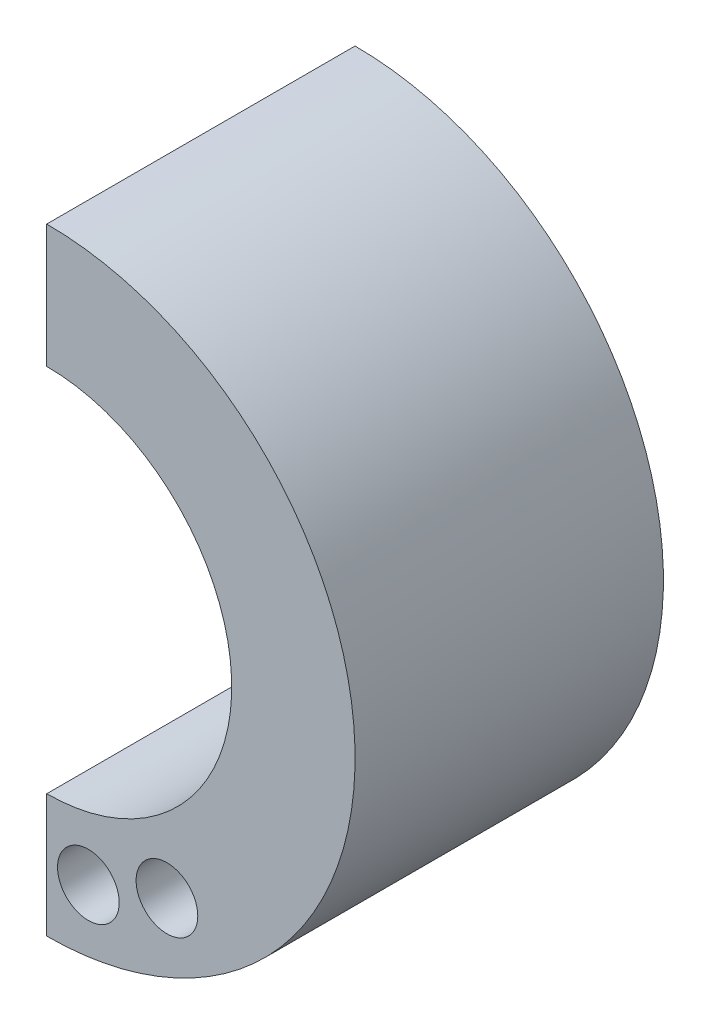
ISO-10303-21;
HEADER;
FILE_DESCRIPTION(('STEP AP214'),'2;1');
FILE_NAME('part.step','',(''),(''),'','','');
FILE_SCHEMA(('AUTOMOTIVE_DESIGN { 1 0 10303 214 1 1 1 1 }'));
ENDSEC;
DATA;
#1=APPLICATION_CONTEXT('core data for automotive mechanical design processes');
#2=APPLICATION_PROTOCOL_DEFINITION('international standard','automotive_design',2000,#1);
#3=PRODUCT_CONTEXT('',#1,'mechanical');
#4=PRODUCT('Part','Part','',(#3));
#5=PRODUCT_RELATED_PRODUCT_CATEGORY('part','',(#4));
#6=PRODUCT_DEFINITION_FORMATION('','',#4);
#7=PRODUCT_DEFINITION_CONTEXT('part definition',#1,'design');
#8=PRODUCT_DEFINITION('design','',#6,#7);
#9=PRODUCT_DEFINITION_SHAPE('','',#8);
#10=(LENGTH_UNIT() NAMED_UNIT(*) SI_UNIT(.MILLI.,.METRE.));
#11=(NAMED_UNIT(*) PLANE_ANGLE_UNIT() SI_UNIT($,.RADIAN.));
#12=(NAMED_UNIT(*) SI_UNIT($,.STERADIAN.) SOLID_ANGLE_UNIT());
#13=UNCERTAINTY_MEASURE_WITH_UNIT(LENGTH_MEASURE(1.E-05),#10,'distance_accuracy_value','');
#14=(GEOMETRIC_REPRESENTATION_CONTEXT(3) GLOBAL_UNCERTAINTY_ASSIGNED_CONTEXT((#13)) GLOBAL_UNIT_ASSIGNED_CONTEXT((#10,
#11,#12)) REPRESENTATION_CONTEXT('',''));
#15=CARTESIAN_POINT('',(0.,0.,0.));
#16=DIRECTION('',(0.,0.,1.));
#17=DIRECTION('',(1.,0.,0.));
#18=AXIS2_PLACEMENT_3D('',#15,#16,#17);
#19=CARTESIAN_POINT('',(0.,50.,50.));
#20=DIRECTION('',(1.,0.,0.));
#21=DIRECTION('',(0.,0.,-1.));
#22=AXIS2_PLACEMENT_3D('',#19,#20,#21);
#23=PLANE('',#22);
#24=DIRECTION('',(0.,-1.,0.));
#25=VECTOR('',#24,1.);
#26=CARTESIAN_POINT('',(0.,50.,0.));
#27=LINE('',#26,#25);
#28=CARTESIAN_POINT('',(0.,50.,0.));
#29=VERTEX_POINT('',#28);
#30=CARTESIAN_POINT('',(0.,30.,0.));
#31=VERTEX_POINT('',#30);
#32=EDGE_CURVE('E79',#29,#31,#27,.T.);
#33=ORIENTED_EDGE('',*,*,#32,.T.);
#34=DIRECTION('',(0.,0.,1.));
#35=VECTOR('',#34,1.);
#36=CARTESIAN_POINT('',(0.,30.,0.));
#37=LINE('',#36,#35);
#38=CARTESIAN_POINT('',(0.,30.,50.));
#39=VERTEX_POINT('',#38);
#40=EDGE_CURVE('E44',#31,#39,#37,.T.);
#41=ORIENTED_EDGE('',*,*,#40,.T.);
#42=DIRECTION('',(0.,-1.,0.));
#43=VECTOR('',#42,1.);
#44=CARTESIAN_POINT('',(0.,50.,50.));
#45=LINE('',#44,#43);
#46=CARTESIAN_POINT('',(0.,50.,50.));
#47=VERTEX_POINT('',#46);
#48=EDGE_CURVE('E78',#47,#39,#45,.T.);
#49=ORIENTED_EDGE('',*,*,#48,.F.);
#50=DIRECTION('',(0.,0.,-1.));
#51=VECTOR('',#50,1.);
#52=CARTESIAN_POINT('',(0.,50.,50.));
#53=LINE('',#52,#51);
#54=EDGE_CURVE('E11',#47,#29,#53,.T.);
#55=ORIENTED_EDGE('',*,*,#54,.T.);
#56=EDGE_LOOP('',(#33,#41,#49,#55));
#57=FACE_BOUND('',#56,.T.);
#58=ADVANCED_FACE('F29',(#57),#23,.F.);
#59=CARTESIAN_POINT('',(0.,0.,50.));
#60=DIRECTION('',(0.,0.,-1.));
#61=DIRECTION('',(-1.,0.,0.));
#62=AXIS2_PLACEMENT_3D('',#59,#60,#61);
#63=CYLINDRICAL_SURFACE('',#62,50.);
#64=CARTESIAN_POINT('',(0.,0.,0.));
#65=DIRECTION('',(0.,0.,1.));
#66=DIRECTION('',(1.,0.,0.));
#67=AXIS2_PLACEMENT_3D('',#64,#65,#66);
#68=CIRCLE('',#67,50.);
#69=CARTESIAN_POINT('',(0.,-50.,0.));
#70=VERTEX_POINT('',#69);
#71=EDGE_CURVE('E92',#70,#29,#68,.T.);
#72=ORIENTED_EDGE('',*,*,#71,.T.);
#73=ORIENTED_EDGE('',*,*,#54,.F.);
#74=CARTESIAN_POINT('',(0.,0.,50.));
#75=DIRECTION('',(0.,0.,1.));
#76=DIRECTION('',(1.,0.,0.));
#77=AXIS2_PLACEMENT_3D('',#74,#75,#76);
#78=CIRCLE('',#77,50.);
#79=CARTESIAN_POINT('',(0.,-50.,50.));
#80=VERTEX_POINT('',#79);
#81=EDGE_CURVE('E84',#80,#47,#78,.T.);
#82=ORIENTED_EDGE('',*,*,#81,.F.);
#83=DIRECTION('',(0.,0.,-1.));
#84=VECTOR('',#83,1.);
#85=CARTESIAN_POINT('',(0.,-50.,50.));
#86=LINE('',#85,#84);
#87=EDGE_CURVE('E37',#80,#70,#86,.T.);
#88=ORIENTED_EDGE('',*,*,#87,.T.);
#89=EDGE_LOOP('',(#72,#73,#82,#88));
#90=FACE_BOUND('',#89,.T.);
#91=ADVANCED_FACE('F31',(#90),#63,.T.);
#92=CARTESIAN_POINT('',(0.,-30.,50.));
#93=VERTEX_POINT('',#92);
#94=EDGE_CURVE('E52',#93,#80,#45,.T.);
#95=ORIENTED_EDGE('',*,*,#94,.F.);
#96=DIRECTION('',(0.,0.,1.));
#97=VECTOR('',#96,1.);
#98=CARTESIAN_POINT('',(0.,-30.,0.));
#99=LINE('',#98,#97);
#100=CARTESIAN_POINT('',(0.,-30.,0.));
#101=VERTEX_POINT('',#100);
#102=EDGE_CURVE('E72',#101,#93,#99,.T.);
#103=ORIENTED_EDGE('',*,*,#102,.F.);
#104=EDGE_CURVE('E91',#101,#70,#27,.T.);
#105=ORIENTED_EDGE('',*,*,#104,.T.);
#106=ORIENTED_EDGE('',*,*,#87,.F.);
#107=EDGE_LOOP('',(#95,#103,#105,#106));
#108=FACE_BOUND('',#107,.T.);
#109=ADVANCED_FACE('F113',(#108),#23,.F.);
#110=CARTESIAN_POINT('',(0.,0.,50.));
#111=DIRECTION('',(0.,0.,1.));
#112=DIRECTION('',(1.,0.,0.));
#113=AXIS2_PLACEMENT_3D('',#110,#111,#112);
#114=PLANE('',#113);
#115=CARTESIAN_POINT('',(0.,0.,50.));
#116=DIRECTION('',(0.,0.,1.));
#117=DIRECTION('',(-1.,0.,0.));
#118=AXIS2_PLACEMENT_3D('',#115,#116,#117);
#119=CIRCLE('',#118,30.);
#120=EDGE_CURVE('E69',#93,#39,#119,.T.);
#121=ORIENTED_EDGE('',*,*,#120,.F.);
#122=ORIENTED_EDGE('',*,*,#94,.T.);
#123=ORIENTED_EDGE('',*,*,#81,.T.);
#124=ORIENTED_EDGE('',*,*,#48,.T.);
#125=EDGE_LOOP('',(#121,#122,#123,#124));
#126=FACE_BOUND('',#125,.T.);
#127=CARTESIAN_POINT('',(19.4926154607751,-34.9290415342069,50.));
#128=DIRECTION('',(0.,0.,1.));
#129=DIRECTION('',(1.,0.,0.));
#130=AXIS2_PLACEMENT_3D('',#127,#128,#129);
#131=CIRCLE('',#130,5.);
#132=CARTESIAN_POINT('',(24.4926154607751,-34.9290415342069,50.));
#133=VERTEX_POINT('',#132);
#134=EDGE_CURVE('E104',#133,#133,#131,.T.);
#135=ORIENTED_EDGE('',*,*,#134,.F.);
#136=EDGE_LOOP('',(#135));
#137=FACE_BOUND('',#136,.T.);
#138=CARTESIAN_POINT('',(6.75276244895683,-39.4258823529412,50.));
#139=DIRECTION('',(0.,0.,1.));
#140=DIRECTION('',(1.,0.,0.));
#141=AXIS2_PLACEMENT_3D('',#138,#139,#140);
#142=CIRCLE('',#141,5.);
#143=CARTESIAN_POINT('',(11.7527624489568,-39.4258823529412,50.));
#144=VERTEX_POINT('',#143);
#145=EDGE_CURVE('E98',#144,#144,#142,.T.);
#146=ORIENTED_EDGE('',*,*,#145,.F.);
#147=EDGE_LOOP('',(#146));
#148=FACE_BOUND('',#147,.T.);
#149=ADVANCED_FACE('F81',(#126,#137,#148),#114,.T.);
#150=CARTESIAN_POINT('',(0.,0.,0.));
#151=DIRECTION('',(0.,0.,1.));
#152=DIRECTION('',(1.,0.,0.));
#153=AXIS2_PLACEMENT_3D('',#150,#151,#152);
#154=PLANE('',#153);
#155=CARTESIAN_POINT('',(19.4926154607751,-34.9290415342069,0.));
#156=DIRECTION('',(0.,0.,1.));
#157=DIRECTION('',(1.,0.,0.));
#158=AXIS2_PLACEMENT_3D('',#155,#156,#157);
#159=CIRCLE('',#158,5.);
#160=CARTESIAN_POINT('',(24.4926154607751,-34.9290415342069,0.));
#161=VERTEX_POINT('',#160);
#162=EDGE_CURVE('E101',#161,#161,#159,.T.);
#163=ORIENTED_EDGE('',*,*,#162,.T.);
#164=EDGE_LOOP('',(#163));
#165=FACE_BOUND('',#164,.T.);
#166=CARTESIAN_POINT('',(6.75276244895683,-39.4258823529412,0.));
#167=DIRECTION('',(0.,0.,1.));
#168=DIRECTION('',(1.,0.,0.));
#169=AXIS2_PLACEMENT_3D('',#166,#167,#168);
#170=CIRCLE('',#169,5.);
#171=CARTESIAN_POINT('',(11.7527624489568,-39.4258823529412,0.));
#172=VERTEX_POINT('',#171);
#173=EDGE_CURVE('E95',#172,#172,#170,.T.);
#174=ORIENTED_EDGE('',*,*,#173,.T.);
#175=EDGE_LOOP('',(#174));
#176=FACE_BOUND('',#175,.T.);
#177=ORIENTED_EDGE('',*,*,#104,.F.);
#178=CARTESIAN_POINT('',(0.,0.,0.));
#179=DIRECTION('',(0.,0.,1.));
#180=DIRECTION('',(-1.,0.,0.));
#181=AXIS2_PLACEMENT_3D('',#178,#179,#180);
#182=CIRCLE('',#181,30.);
#183=EDGE_CURVE('E74',#101,#31,#182,.T.);
#184=ORIENTED_EDGE('',*,*,#183,.T.);
#185=ORIENTED_EDGE('',*,*,#32,.F.);
#186=ORIENTED_EDGE('',*,*,#71,.F.);
#187=EDGE_LOOP('',(#177,#184,#185,#186));
#188=FACE_BOUND('',#187,.T.);
#189=ADVANCED_FACE('F110',(#165,#176,#188),#154,.F.);
#190=CARTESIAN_POINT('',(6.75276244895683,-39.4258823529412,0.));
#191=DIRECTION('',(0.,0.,1.));
#192=DIRECTION('',(1.,0.,0.));
#193=AXIS2_PLACEMENT_3D('',#190,#191,#192);
#194=CYLINDRICAL_SURFACE('',#193,5.);
#195=ORIENTED_EDGE('',*,*,#173,.F.);
#196=EDGE_LOOP('',(#195));
#197=FACE_BOUND('',#196,.T.);
#198=ORIENTED_EDGE('',*,*,#145,.T.);
#199=EDGE_LOOP('',(#198));
#200=FACE_BOUND('',#199,.T.);
#201=ADVANCED_FACE('F129',(#197,#200),#194,.F.);
#202=CARTESIAN_POINT('',(19.4926154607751,-34.9290415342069,0.));
#203=DIRECTION('',(0.,0.,1.));
#204=DIRECTION('',(1.,0.,0.));
#205=AXIS2_PLACEMENT_3D('',#202,#203,#204);
#206=CYLINDRICAL_SURFACE('',#205,5.);
#207=ORIENTED_EDGE('',*,*,#162,.F.);
#208=EDGE_LOOP('',(#207));
#209=FACE_BOUND('',#208,.T.);
#210=ORIENTED_EDGE('',*,*,#134,.T.);
#211=EDGE_LOOP('',(#210));
#212=FACE_BOUND('',#211,.T.);
#213=ADVANCED_FACE('F132',(#209,#212),#206,.F.);
#214=CARTESIAN_POINT('',(0.,0.,0.));
#215=DIRECTION('',(0.,0.,1.));
#216=DIRECTION('',(1.,0.,0.));
#217=AXIS2_PLACEMENT_3D('',#214,#215,#216);
#218=CYLINDRICAL_SURFACE('',#217,30.);
#219=ORIENTED_EDGE('',*,*,#120,.T.);
#220=ORIENTED_EDGE('',*,*,#40,.F.);
#221=ORIENTED_EDGE('',*,*,#183,.F.);
#222=ORIENTED_EDGE('',*,*,#102,.T.);
#223=EDGE_LOOP('',(#219,#220,#221,#222));
#224=FACE_BOUND('',#223,.T.);
#225=ADVANCED_FACE('F70',(#224),#218,.F.);
#226=CLOSED_SHELL('',(#58,#91,#109,#149,#189,#201,#213,#225));
#227=MANIFOLD_SOLID_BREP('B2',#226);
#228=ADVANCED_BREP_SHAPE_REPRESENTATION('',(#18,#227),#14);
#229=SHAPE_DEFINITION_REPRESENTATION(#9,#228);
ENDSEC;
END-ISO-10303-21;
